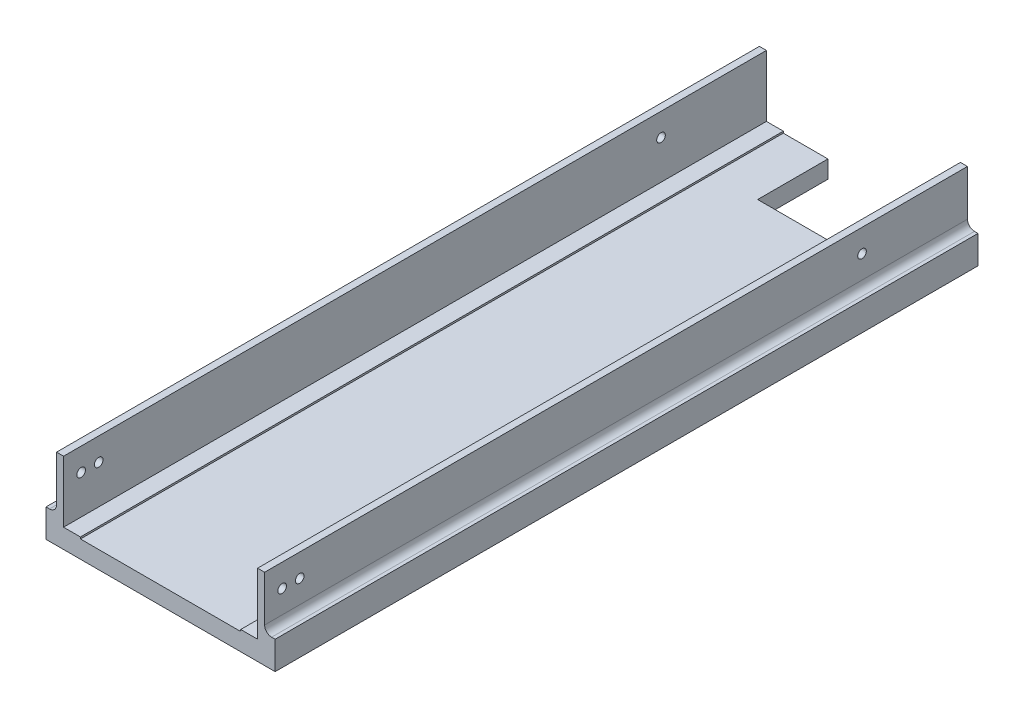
from build123d import *

# Parameters (mm, degrees)
BOSS_EXTRUDE1_DEPTH      = 400
SKETCH2_R                = 2.1
CUT_EXTRUDE3_DEPTH       = 10
SKETCH3_W                = 158.039132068
SKETCH3_H                = 497.98789011
CUT_EXTRUDE4_DEPTH       = 2
SKETCH4_W                = 4.8
SKETCH4_H                = 400
BOSS_EXTRUDE2_DEPTH      = 8
SKETCH5_R                = 1.2
CUT_EXTRUDE9_DEPTH       = 406.158043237
SKETCH9_R                = 1.225
CUT_EXTRUDE10_DEPTH      = 406.931077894
SKETCH10_W               = 4.8
SKETCH10_H               = 400
CUT_EXTRUDE11_DEPTH      = 5
BOSS_EXTRUDE3_START      = -15
SKETCH12_R               = 2.1
BOSS_EXTRUDE3_DEPTH      = 15
SKETCH13_W               = 6.18
SKETCH13_H               = 37.25
BOSS_EXTRUDE5_DEPTH      = 10
BOSS_EXTRUDE6_DEPTH      = 6.18
SKETCH15_R               = 1.05
CUT_EXTRUDE12_DEPTH      = 10
FILLET1_R                = 2
SKETCH16_W               = 4.8
SKETCH16_H               = 400
CUT_EXTRUDE13_DEPTH      = 2.5
CUT_EXTRUDE14_REACH      = 404.247
SKETCH17_R               = 1.16
CUT_EXTRUDE16_DEPTH      = 406.158043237
CUT_EXTRUDE16_DEPTH_BACK = 406.158043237
SKETCH18_R               = 1.225
CUT_EXTRUDE17_DEPTH      = 406.158043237
CUT_EXTRUDE17_DEPTH_BACK = 406.158043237
SKETCH20_R               = 1.225
SKETCH22_W               = 3
SKETCH22_H               = 15
CUT_EXTRUDE18_DEPTH      = 406.931077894
FILLET2_R                = 2
FILLET3_R                = 2
SKETCH24_W               = 20.2
SKETCH24_H               = 20
SKETCH24_W_2             = 2
SKETCH24_H_2             = 200
SKETCH24_W_3             = 3
CUT_EXTRUDE21_DEPTH      = 406.931077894


with BuildPart() as part:
    # Sketch1 → Boss-Extrude1 (new body)
    with BuildSketch(Plane.XY):
        Polygon((0, 0), (0, 25), (5, 25), (5, 5), (60.2, 5), (60.2, 25), (65.2, 25), (65.2, 0), align=None)
    extrude(amount=BOSS_EXTRUDE1_DEPTH)

    # Sketch2 → Cut-Extrude3 (cut)
    with BuildSketch(Plane(origin=(0, 5, 0), x_dir=(1, 0, 0), z_dir=(0, 1, 0))):
        with Locations(Location((32.6, -67.17, 0), (0, 0, 270))):
            Circle(SKETCH2_R)
        with Locations(Location((32.6, -96.92, 0), (0, 0, 270))):
            Circle(SKETCH2_R)
    extrude(amount=-CUT_EXTRUDE3_DEPTH, mode=Mode.SUBTRACT)

    # Sketch3 → Cut-Extrude4 (cut)
    with BuildSketch(Plane(origin=(0, 25, 0), x_dir=(1, 0, 0), z_dir=(0, 1, 0))):
        with Locations((44.123686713, -201.646240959)):
            Rectangle(SKETCH3_W, SKETCH3_H)
    extrude(amount=-CUT_EXTRUDE4_DEPTH, mode=Mode.SUBTRACT)

    # Sketch4 → Boss-Extrude2 (add)
    with BuildSketch(Plane(origin=(0, 5, 0), x_dir=(1, 0, 0), z_dir=(0, 1, 0))):
        with Locations((7.4, -200)):
            Rectangle(SKETCH4_W, SKETCH4_H)
        with Locations((57.8, -200)):
            Rectangle(SKETCH4_W, SKETCH4_H)
    extrude(amount=BOSS_EXTRUDE2_DEPTH)

    # Sketch5 → Cut-Extrude9 (cut, through all)
    with BuildSketch(Plane(origin=(5, 0, 0), x_dir=(0, 0, -1), z_dir=(1, 0, 0))):
        with Locations(Location((-395, 16.5, 0), (0, 0, 90))):
            Circle(SKETCH5_R)
        with Locations(Location((-390, 16.5, 0), (0, 0, 90))):
            Circle(SKETCH5_R)
        with Locations(Location((-10, 16.5, 0), (0, 0, 90))):
            Circle(SKETCH5_R)
        with Locations(Location((-5, 16.5, 0), (0, 0, 90))):
            Circle(SKETCH5_R)
    extrude(amount=-CUT_EXTRUDE9_DEPTH, mode=Mode.SUBTRACT)

    # Sketch9 → Cut-Extrude10 (cut, through all)
    with BuildSketch(Plane.ZY):
        with Locations((5, 16.5)):
            Circle(SKETCH9_R)
        with Locations((10, 16.5)):
            Circle(SKETCH9_R)
        with Locations((390, 16.5)):
            Circle(SKETCH9_R)
        with Locations((395, 16.5)):
            Circle(SKETCH9_R)
    extrude(amount=-CUT_EXTRUDE10_DEPTH, mode=Mode.SUBTRACT)

    # Sketch10 → Cut-Extrude11 (cut)
    with BuildSketch(Plane(origin=(0, 13, 0), x_dir=(1, 0, 0), z_dir=(0, 1, 0))):
        with Locations((7.4, -200)):
            Rectangle(SKETCH10_W, SKETCH10_H)
        with Locations((57.8, -200)):
            Rectangle(SKETCH10_W, SKETCH10_H)
    extrude(amount=-CUT_EXTRUDE11_DEPTH, mode=Mode.SUBTRACT)

    # Sketch12 → Boss-Extrude3 (add)
    with BuildSketch(Plane.XZ.offset(BOSS_EXTRUDE3_START)):
        with Locations(Location((32.6, 96.92, 0), (0, 0, 270))):
            Circle(SKETCH12_R)
        with Locations(Location((32.6, 67.17, 0), (0, 0, 270))):
            Circle(SKETCH12_R)
    extrude(amount=BOSS_EXTRUDE3_DEPTH)

    # Sketch13 → Boss-Extrude5 (add)
    with BuildSketch(Plane(origin=(0, 5, 0), x_dir=(1, 0, 0), z_dir=(0, 1, 0))):
        with Locations((32.6, -82.045)):
            Rectangle(SKETCH13_W, SKETCH13_H)
    extrude(amount=BOSS_EXTRUDE5_DEPTH)

    # Sketch14 → Boss-Extrude6 (add)
    with BuildSketch(Plane.ZY.offset(-29.51)):
        Polygon((70.92, 15), (75.32, 19.4), (88.77, 19.4), (93.17, 15), align=None)
    extrude(amount=-BOSS_EXTRUDE6_DEPTH)

    # Sketch15 → Cut-Extrude12 (cut)
    with BuildSketch(Plane.ZY.offset(-29.51)):
        with Locations((78.87, 16)):
            Circle(SKETCH15_R)
        with Locations((85.22, 16)):
            Circle(SKETCH15_R)
    extrude(amount=-CUT_EXTRUDE12_DEPTH, mode=Mode.SUBTRACT)

    # Fillet1
    fillet1_edges = [part.edges().sort_by_distance(p)[0] for p in [
        (29.51, 5, 82.045),
        (29.51, 10, 63.42),
        (32.6, 5, 100.67),
        (29.51, 10, 100.67),
        (35.69, 5, 82.045),
        (35.69, 10, 100.67),
        (32.6, 5, 63.42),
        (35.69, 10, 63.42),
    ]]
    fillet(fillet1_edges, radius=FILLET1_R)

    # Sketch16 → Cut-Extrude13 (cut)
    with BuildSketch(Plane(origin=(0, 8, 0), x_dir=(1, 0, 0), z_dir=(0, 1, 0))):
        with Locations((7.4, -200)):
            Rectangle(SKETCH16_W, SKETCH16_H)
        with Locations((57.8, -200)):
            Rectangle(SKETCH16_W, SKETCH16_H)
    extrude(amount=-CUT_EXTRUDE13_DEPTH, mode=Mode.SUBTRACT)

    # Sketch17 → Cut-Extrude14 (cut, up to next)
    with BuildSketch(Plane.ZY.offset(-29.51), mode=Mode.PRIVATE) as cut_extrude14_sk1:
        with Locations((78.87, 16)):
            Circle(SKETCH17_R)
    cut_extrude14_tool1 = extrude(cut_extrude14_sk1.sketch, amount=-CUT_EXTRUDE14_REACH, mode=Mode.PRIVATE) & part.part
    # Sketch17 → Cut-Extrude14 (cut, up to next)
    with BuildSketch(Plane.ZY.offset(-29.51), mode=Mode.PRIVATE) as cut_extrude14_sk2:
        with Locations((85.22, 16)):
            Circle(SKETCH17_R)
    cut_extrude14_tool2 = extrude(cut_extrude14_sk2.sketch, amount=-CUT_EXTRUDE14_REACH, mode=Mode.PRIVATE) & part.part
    add(cut_extrude14_tool1.solids().sort_by_distance((29.51, 16, 78.87))[0], mode=Mode.SUBTRACT)
    add(cut_extrude14_tool2.solids().sort_by_distance((29.51, 16, 85.22))[0], mode=Mode.SUBTRACT)

    # Sketch18 → Cut-Extrude16 (cut, two sides: drawn at the far end of the back side and taken through both)
    with BuildSketch(Plane.ZY.offset(-60.2).offset(-CUT_EXTRUDE16_DEPTH_BACK)):
        with Locations((170, 16.5)):
            Circle(SKETCH18_R)
    extrude(amount=CUT_EXTRUDE16_DEPTH + CUT_EXTRUDE16_DEPTH_BACK, mode=Mode.SUBTRACT)

    # Sketch20 → Cut-Extrude17 (cut, two sides: drawn at the far end of the back side and taken through both)
    with BuildSketch(Plane.ZY.offset(-60.2).offset(-CUT_EXTRUDE17_DEPTH_BACK)):
        with Locations((230, 16.5)):
            Circle(SKETCH20_R)
    extrude(amount=CUT_EXTRUDE17_DEPTH + CUT_EXTRUDE17_DEPTH_BACK, mode=Mode.SUBTRACT)

    # Sketch22 → Cut-Extrude18 (cut, through all)
    with BuildSketch(Plane(origin=(0, 0, 0), x_dir=(-1, 0, 0), z_dir=(0, 0, -1))):
        with Locations((-63.7, 15.5)):
            Rectangle(SKETCH22_W, SKETCH22_H)
        with Locations((-1.5, 15.5)):
            Rectangle(SKETCH22_W, SKETCH22_H)
    extrude(amount=-CUT_EXTRUDE18_DEPTH, mode=Mode.SUBTRACT)

    # Fillet2
    fillet2_edges = [part.edges().sort_by_distance(p)[0] for p in [
        (62.2, 8, 200),
    ]]
    fillet(fillet2_edges, radius=FILLET2_R)

    # Fillet3
    fillet3_edges = [part.edges().sort_by_distance(p)[0] for p in [
        (3, 8, 200),
    ]]
    fillet(fillet3_edges, radius=FILLET3_R)

    # Sketch24 → Cut-Extrude21 (cut, through all)
    with BuildSketch(Plane(origin=(0, 23, 0), x_dir=(1, 0, 0), z_dir=(0, 1, 0))):
        Polygon((0, 0), (0, -200), (22.5, -200), (42.7, -200), (60.2, -200), (60.2, 0), align=None)
        with Locations((32.6, -210)):
            Rectangle(SKETCH24_W, SKETCH24_H)
        with Locations((61.2, -100)):
            Rectangle(SKETCH24_W_2, SKETCH24_H_2)
        with Locations((63.7, -100)):
            Rectangle(SKETCH24_W_3, SKETCH24_H_2)
    extrude(amount=-CUT_EXTRUDE21_DEPTH, mode=Mode.SUBTRACT)


solid = part.part
